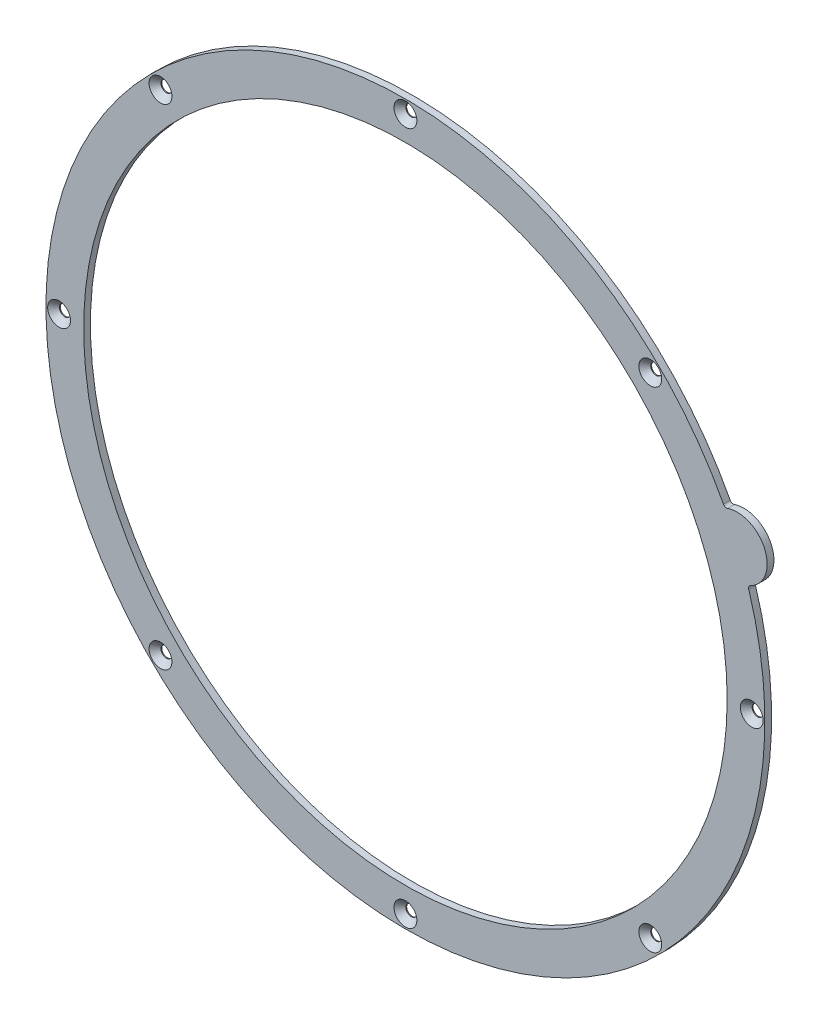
ISO-10303-21;
HEADER;
FILE_DESCRIPTION(('STEP AP214'),'2;1');
FILE_NAME('part.step','',(''),(''),'','','');
FILE_SCHEMA(('AUTOMOTIVE_DESIGN { 1 0 10303 214 1 1 1 1 }'));
ENDSEC;
DATA;
#1=APPLICATION_CONTEXT('core data for automotive mechanical design processes');
#2=APPLICATION_PROTOCOL_DEFINITION('international standard','automotive_design',2000,#1);
#3=PRODUCT_CONTEXT('',#1,'mechanical');
#4=PRODUCT('Part','Part','',(#3));
#5=PRODUCT_RELATED_PRODUCT_CATEGORY('part','',(#4));
#6=PRODUCT_DEFINITION_FORMATION('','',#4);
#7=PRODUCT_DEFINITION_CONTEXT('part definition',#1,'design');
#8=PRODUCT_DEFINITION('design','',#6,#7);
#9=PRODUCT_DEFINITION_SHAPE('','',#8);
#10=(LENGTH_UNIT() NAMED_UNIT(*) SI_UNIT(.MILLI.,.METRE.));
#11=(NAMED_UNIT(*) PLANE_ANGLE_UNIT() SI_UNIT($,.RADIAN.));
#12=(NAMED_UNIT(*) SI_UNIT($,.STERADIAN.) SOLID_ANGLE_UNIT());
#13=UNCERTAINTY_MEASURE_WITH_UNIT(LENGTH_MEASURE(1.E-05),#10,'distance_accuracy_value','');
#14=(GEOMETRIC_REPRESENTATION_CONTEXT(3) GLOBAL_UNCERTAINTY_ASSIGNED_CONTEXT((#13)) GLOBAL_UNIT_ASSIGNED_CONTEXT((#10,
#11,#12)) REPRESENTATION_CONTEXT('',''));
#15=CARTESIAN_POINT('',(0.,0.,0.));
#16=DIRECTION('',(0.,0.,1.));
#17=DIRECTION('',(1.,0.,0.));
#18=AXIS2_PLACEMENT_3D('',#15,#16,#17);
#19=CARTESIAN_POINT('',(0.,0.,4.));
#20=DIRECTION('',(0.,0.,1.));
#21=DIRECTION('',(1.,0.,0.));
#22=AXIS2_PLACEMENT_3D('',#19,#20,#21);
#23=PLANE('',#22);
#24=CARTESIAN_POINT('',(195.862460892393,81.1288876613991,4.));
#25=DIRECTION('',(0.,0.,1.));
#26=DIRECTION('',(1.,0.,0.));
#27=AXIS2_PLACEMENT_3D('',#24,#25,#26);
#28=CIRCLE('',#27,17.75);
#29=CARTESIAN_POINT('',(203.753669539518,65.2294749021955,4.));
#30=VERTEX_POINT('',#29);
#31=CARTESIAN_POINT('',(190.199805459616,97.9513973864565,4.));
#32=VERTEX_POINT('',#31);
#33=EDGE_CURVE('E161',#30,#32,#28,.T.);
#34=ORIENTED_EDGE('',*,*,#33,.T.);
#35=CARTESIAN_POINT('',(189.56175977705,99.8468914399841,4.));
#36=DIRECTION('',(0.,0.,1.));
#37=DIRECTION('',(1.,0.,0.));
#38=AXIS2_PLACEMENT_3D('',#35,#36,#37);
#39=CIRCLE('',#38,2.);
#40=CARTESIAN_POINT('',(187.792221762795,98.9148317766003,4.));
#41=VERTEX_POINT('',#40);
#42=EDGE_CURVE('E85',#32,#41,#39,.F.);
#43=ORIENTED_EDGE('',*,*,#42,.T.);
#44=CARTESIAN_POINT('',(0.,0.,4.));
#45=DIRECTION('',(0.,0.,1.));
#46=DIRECTION('',(1.,0.,0.));
#47=AXIS2_PLACEMENT_3D('',#44,#45,#46);
#48=CIRCLE('',#47,212.25);
#49=CARTESIAN_POINT('',(202.732501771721,62.8458051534,4.));
#50=VERTEX_POINT('',#49);
#51=EDGE_CURVE('E94',#41,#50,#48,.T.);
#52=ORIENTED_EDGE('',*,*,#51,.T.);
#53=CARTESIAN_POINT('',(204.642819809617,63.4379917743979,4.));
#54=DIRECTION('',(0.,0.,1.));
#55=DIRECTION('',(1.,0.,0.));
#56=AXIS2_PLACEMENT_3D('',#53,#54,#55);
#57=CIRCLE('',#56,2.);
#58=EDGE_CURVE('E46',#50,#30,#57,.F.);
#59=ORIENTED_EDGE('',*,*,#58,.T.);
#60=EDGE_LOOP('',(#34,#43,#52,#59));
#61=FACE_BOUND('',#60,.T.);
#62=CARTESIAN_POINT('',(-144.603336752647,144.603336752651,4.));
#63=DIRECTION('',(0.,0.,1.));
#64=DIRECTION('',(1.,0.,0.));
#65=AXIS2_PLACEMENT_3D('',#62,#63,#64);
#66=CIRCLE('',#65,6.75000000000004);
#67=CARTESIAN_POINT('',(-137.853336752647,144.603336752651,4.));
#68=VERTEX_POINT('',#67);
#69=EDGE_CURVE('E154',#68,#68,#66,.F.);
#70=ORIENTED_EDGE('',*,*,#69,.T.);
#71=EDGE_LOOP('',(#70));
#72=FACE_BOUND('',#71,.T.);
#73=CARTESIAN_POINT('',(-204.5,2.14202380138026E-12,4.));
#74=DIRECTION('',(0.,0.,1.));
#75=DIRECTION('',(1.,0.,0.));
#76=AXIS2_PLACEMENT_3D('',#73,#74,#75);
#77=CIRCLE('',#76,6.75000000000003);
#78=CARTESIAN_POINT('',(-197.75,2.14202380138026E-12,4.));
#79=VERTEX_POINT('',#78);
#80=EDGE_CURVE('E148',#79,#79,#77,.F.);
#81=ORIENTED_EDGE('',*,*,#80,.T.);
#82=EDGE_LOOP('',(#81));
#83=FACE_BOUND('',#82,.T.);
#84=CARTESIAN_POINT('',(-144.60333675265,-144.603336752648,4.));
#85=DIRECTION('',(0.,0.,1.));
#86=DIRECTION('',(1.,0.,0.));
#87=AXIS2_PLACEMENT_3D('',#84,#85,#86);
#88=CIRCLE('',#87,6.74999999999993);
#89=CARTESIAN_POINT('',(-137.85333675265,-144.603336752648,4.));
#90=VERTEX_POINT('',#89);
#91=EDGE_CURVE('E142',#90,#90,#88,.F.);
#92=ORIENTED_EDGE('',*,*,#91,.T.);
#93=EDGE_LOOP('',(#92));
#94=FACE_BOUND('',#93,.T.);
#95=CARTESIAN_POINT('',(-1.42801586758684E-12,-204.5,4.));
#96=DIRECTION('',(0.,0.,1.));
#97=DIRECTION('',(1.,0.,0.));
#98=AXIS2_PLACEMENT_3D('',#95,#96,#97);
#99=CIRCLE('',#98,6.75000000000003);
#100=CARTESIAN_POINT('',(6.74999999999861,-204.5,4.));
#101=VERTEX_POINT('',#100);
#102=EDGE_CURVE('E136',#101,#101,#99,.F.);
#103=ORIENTED_EDGE('',*,*,#102,.T.);
#104=EDGE_LOOP('',(#103));
#105=FACE_BOUND('',#104,.T.);
#106=CARTESIAN_POINT('',(144.603336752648,-144.60333675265,4.));
#107=DIRECTION('',(0.,0.,1.));
#108=DIRECTION('',(1.,0.,0.));
#109=AXIS2_PLACEMENT_3D('',#106,#107,#108);
#110=CIRCLE('',#109,6.74999999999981);
#111=CARTESIAN_POINT('',(151.353336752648,-144.60333675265,4.));
#112=VERTEX_POINT('',#111);
#113=EDGE_CURVE('E130',#112,#112,#110,.F.);
#114=ORIENTED_EDGE('',*,*,#113,.T.);
#115=EDGE_LOOP('',(#114));
#116=FACE_BOUND('',#115,.T.);
#117=CARTESIAN_POINT('',(204.5,-7.14007933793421E-13,4.));
#118=DIRECTION('',(0.,0.,1.));
#119=DIRECTION('',(1.,0.,0.));
#120=AXIS2_PLACEMENT_3D('',#117,#118,#119);
#121=CIRCLE('',#120,6.75000000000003);
#122=CARTESIAN_POINT('',(211.25,-7.14007933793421E-13,4.));
#123=VERTEX_POINT('',#122);
#124=EDGE_CURVE('E124',#123,#123,#121,.F.);
#125=ORIENTED_EDGE('',*,*,#124,.T.);
#126=EDGE_LOOP('',(#125));
#127=FACE_BOUND('',#126,.T.);
#128=CARTESIAN_POINT('',(144.603336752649,144.603336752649,4.));
#129=DIRECTION('',(0.,0.,1.));
#130=DIRECTION('',(1.,0.,0.));
#131=AXIS2_PLACEMENT_3D('',#128,#129,#130);
#132=CIRCLE('',#131,6.74999999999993);
#133=CARTESIAN_POINT('',(151.353336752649,144.603336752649,4.));
#134=VERTEX_POINT('',#133);
#135=EDGE_CURVE('E118',#134,#134,#132,.F.);
#136=ORIENTED_EDGE('',*,*,#135,.T.);
#137=EDGE_LOOP('',(#136));
#138=FACE_BOUND('',#137,.T.);
#139=CARTESIAN_POINT('',(0.,204.5,4.));
#140=DIRECTION('',(0.,0.,1.));
#141=DIRECTION('',(1.,0.,0.));
#142=AXIS2_PLACEMENT_3D('',#139,#140,#141);
#143=CIRCLE('',#142,6.75000000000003);
#144=CARTESIAN_POINT('',(6.75000000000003,204.5,4.));
#145=VERTEX_POINT('',#144);
#146=EDGE_CURVE('E112',#145,#145,#143,.F.);
#147=ORIENTED_EDGE('',*,*,#146,.T.);
#148=EDGE_LOOP('',(#147));
#149=FACE_BOUND('',#148,.T.);
#150=CARTESIAN_POINT('',(0.,0.,4.));
#151=DIRECTION('',(0.,0.,1.));
#152=DIRECTION('',(1.,0.,0.));
#153=AXIS2_PLACEMENT_3D('',#150,#151,#152);
#154=CIRCLE('',#153,190.);
#155=CARTESIAN_POINT('',(190.,0.,4.));
#156=VERTEX_POINT('',#155);
#157=EDGE_CURVE('E101',#156,#156,#154,.T.);
#158=ORIENTED_EDGE('',*,*,#157,.F.);
#159=EDGE_LOOP('',(#158));
#160=FACE_BOUND('',#159,.T.);
#161=ADVANCED_FACE('F38',(#61,#72,#83,#94,#105,#116,#127,#138,#149,#160),#23,.T.);
#162=CARTESIAN_POINT('',(0.,0.,0.));
#163=DIRECTION('',(0.,0.,1.));
#164=DIRECTION('',(1.,0.,0.));
#165=AXIS2_PLACEMENT_3D('',#162,#163,#164);
#166=PLANE('',#165);
#167=CARTESIAN_POINT('',(-144.603336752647,144.603336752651,0.));
#168=DIRECTION('',(0.,0.,1.));
#169=DIRECTION('',(0.707106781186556,0.707106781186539,0.));
#170=AXIS2_PLACEMENT_3D('',#167,#168,#169);
#171=CIRCLE('',#170,3.25);
#172=CARTESIAN_POINT('',(-142.305239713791,146.901433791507,0.));
#173=VERTEX_POINT('',#172);
#174=EDGE_CURVE('E165',#173,#173,#171,.T.);
#175=ORIENTED_EDGE('',*,*,#174,.T.);
#176=EDGE_LOOP('',(#175));
#177=FACE_BOUND('',#176,.T.);
#178=CARTESIAN_POINT('',(-204.5,2.14202380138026E-12,0.));
#179=DIRECTION('',(0.,0.,1.));
#180=DIRECTION('',(0.,1.,0.));
#181=AXIS2_PLACEMENT_3D('',#178,#179,#180);
#182=CIRCLE('',#181,3.25);
#183=CARTESIAN_POINT('',(-204.5,3.25000000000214,0.));
#184=VERTEX_POINT('',#183);
#185=EDGE_CURVE('E170',#184,#184,#182,.T.);
#186=ORIENTED_EDGE('',*,*,#185,.T.);
#187=EDGE_LOOP('',(#186));
#188=FACE_BOUND('',#187,.T.);
#189=CARTESIAN_POINT('',(-144.60333675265,-144.603336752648,0.));
#190=DIRECTION('',(0.,0.,1.));
#191=DIRECTION('',(-0.707106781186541,0.707106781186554,0.));
#192=AXIS2_PLACEMENT_3D('',#189,#190,#191);
#193=CIRCLE('',#192,3.25);
#194=CARTESIAN_POINT('',(-146.901433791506,-142.305239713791,0.));
#195=VERTEX_POINT('',#194);
#196=EDGE_CURVE('E173',#195,#195,#193,.T.);
#197=ORIENTED_EDGE('',*,*,#196,.T.);
#198=EDGE_LOOP('',(#197));
#199=FACE_BOUND('',#198,.T.);
#200=CARTESIAN_POINT('',(-1.42801586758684E-12,-204.5,0.));
#201=DIRECTION('',(0.,0.,1.));
#202=DIRECTION('',(-1.,0.,0.));
#203=AXIS2_PLACEMENT_3D('',#200,#201,#202);
#204=CIRCLE('',#203,3.25);
#205=CARTESIAN_POINT('',(-3.25000000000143,-204.5,0.));
#206=VERTEX_POINT('',#205);
#207=EDGE_CURVE('E176',#206,#206,#204,.T.);
#208=ORIENTED_EDGE('',*,*,#207,.T.);
#209=EDGE_LOOP('',(#208));
#210=FACE_BOUND('',#209,.T.);
#211=CARTESIAN_POINT('',(144.603336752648,-144.60333675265,0.));
#212=DIRECTION('',(0.,0.,1.));
#213=DIRECTION('',(-0.707106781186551,-0.707106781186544,0.));
#214=AXIS2_PLACEMENT_3D('',#211,#212,#213);
#215=CIRCLE('',#214,3.25);
#216=CARTESIAN_POINT('',(142.305239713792,-146.901433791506,0.));
#217=VERTEX_POINT('',#216);
#218=EDGE_CURVE('E179',#217,#217,#215,.T.);
#219=ORIENTED_EDGE('',*,*,#218,.T.);
#220=EDGE_LOOP('',(#219));
#221=FACE_BOUND('',#220,.T.);
#222=CARTESIAN_POINT('',(204.5,-7.14007933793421E-13,0.));
#223=DIRECTION('',(0.,0.,1.));
#224=DIRECTION('',(0.,-1.,0.));
#225=AXIS2_PLACEMENT_3D('',#222,#223,#224);
#226=CIRCLE('',#225,3.25);
#227=CARTESIAN_POINT('',(204.5,-3.25000000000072,0.));
#228=VERTEX_POINT('',#227);
#229=EDGE_CURVE('E182',#228,#228,#226,.T.);
#230=ORIENTED_EDGE('',*,*,#229,.T.);
#231=EDGE_LOOP('',(#230));
#232=FACE_BOUND('',#231,.T.);
#233=CARTESIAN_POINT('',(144.603336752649,144.603336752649,0.));
#234=DIRECTION('',(0.,0.,1.));
#235=DIRECTION('',(0.707106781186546,-0.707106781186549,0.));
#236=AXIS2_PLACEMENT_3D('',#233,#234,#235);
#237=CIRCLE('',#236,3.25);
#238=CARTESIAN_POINT('',(146.901433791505,142.305239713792,0.));
#239=VERTEX_POINT('',#238);
#240=EDGE_CURVE('E185',#239,#239,#237,.T.);
#241=ORIENTED_EDGE('',*,*,#240,.T.);
#242=EDGE_LOOP('',(#241));
#243=FACE_BOUND('',#242,.T.);
#244=CARTESIAN_POINT('',(0.,204.5,0.));
#245=DIRECTION('',(0.,0.,1.));
#246=DIRECTION('',(1.,0.,0.));
#247=AXIS2_PLACEMENT_3D('',#244,#245,#246);
#248=CIRCLE('',#247,3.25);
#249=CARTESIAN_POINT('',(3.25,204.5,0.));
#250=VERTEX_POINT('',#249);
#251=EDGE_CURVE('E188',#250,#250,#248,.T.);
#252=ORIENTED_EDGE('',*,*,#251,.T.);
#253=EDGE_LOOP('',(#252));
#254=FACE_BOUND('',#253,.T.);
#255=CARTESIAN_POINT('',(0.,0.,0.));
#256=DIRECTION('',(0.,0.,1.));
#257=DIRECTION('',(1.,0.,0.));
#258=AXIS2_PLACEMENT_3D('',#255,#256,#257);
#259=CIRCLE('',#258,212.25);
#260=CARTESIAN_POINT('',(187.792221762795,98.9148317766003,0.));
#261=VERTEX_POINT('',#260);
#262=CARTESIAN_POINT('',(202.732501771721,62.8458051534,0.));
#263=VERTEX_POINT('',#262);
#264=EDGE_CURVE('E92',#261,#263,#259,.T.);
#265=ORIENTED_EDGE('',*,*,#264,.F.);
#266=CARTESIAN_POINT('',(189.56175977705,99.8468914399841,0.));
#267=DIRECTION('',(0.,0.,1.));
#268=DIRECTION('',(1.,0.,0.));
#269=AXIS2_PLACEMENT_3D('',#266,#267,#268);
#270=CIRCLE('',#269,2.);
#271=CARTESIAN_POINT('',(190.199805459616,97.9513973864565,0.));
#272=VERTEX_POINT('',#271);
#273=EDGE_CURVE('E77',#261,#272,#270,.T.);
#274=ORIENTED_EDGE('',*,*,#273,.T.);
#275=CARTESIAN_POINT('',(195.862460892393,81.1288876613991,0.));
#276=DIRECTION('',(0.,0.,1.));
#277=DIRECTION('',(1.,0.,0.));
#278=AXIS2_PLACEMENT_3D('',#275,#276,#277);
#279=CIRCLE('',#278,17.75);
#280=CARTESIAN_POINT('',(203.753669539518,65.2294749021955,0.));
#281=VERTEX_POINT('',#280);
#282=EDGE_CURVE('E163',#272,#281,#279,.F.);
#283=ORIENTED_EDGE('',*,*,#282,.T.);
#284=CARTESIAN_POINT('',(204.642819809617,63.4379917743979,0.));
#285=DIRECTION('',(0.,0.,1.));
#286=DIRECTION('',(1.,0.,0.));
#287=AXIS2_PLACEMENT_3D('',#284,#285,#286);
#288=CIRCLE('',#287,2.);
#289=EDGE_CURVE('E11',#281,#263,#288,.T.);
#290=ORIENTED_EDGE('',*,*,#289,.T.);
#291=EDGE_LOOP('',(#265,#274,#283,#290));
#292=FACE_BOUND('',#291,.T.);
#293=CARTESIAN_POINT('',(0.,0.,0.));
#294=DIRECTION('',(0.,0.,1.));
#295=DIRECTION('',(1.,0.,0.));
#296=AXIS2_PLACEMENT_3D('',#293,#294,#295);
#297=CIRCLE('',#296,190.);
#298=CARTESIAN_POINT('',(190.,0.,0.));
#299=VERTEX_POINT('',#298);
#300=EDGE_CURVE('E106',#299,#299,#297,.T.);
#301=ORIENTED_EDGE('',*,*,#300,.T.);
#302=EDGE_LOOP('',(#301));
#303=FACE_BOUND('',#302,.T.);
#304=ADVANCED_FACE('F98',(#177,#188,#199,#210,#221,#232,#243,#254,#292,#303),#166,.F.);
#305=CARTESIAN_POINT('',(0.,0.,4.));
#306=DIRECTION('',(0.,0.,-1.));
#307=DIRECTION('',(-1.,0.,0.));
#308=AXIS2_PLACEMENT_3D('',#305,#306,#307);
#309=CYLINDRICAL_SURFACE('',#308,212.25);
#310=ORIENTED_EDGE('',*,*,#51,.F.);
#311=DIRECTION('',(0.,0.,-1.));
#312=VECTOR('',#311,1.);
#313=CARTESIAN_POINT('',(187.792221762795,98.9148317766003,4.));
#314=LINE('',#313,#312);
#315=EDGE_CURVE('E81',#41,#261,#314,.T.);
#316=ORIENTED_EDGE('',*,*,#315,.T.);
#317=ORIENTED_EDGE('',*,*,#264,.T.);
#318=DIRECTION('',(0.,0.,-1.));
#319=VECTOR('',#318,1.);
#320=CARTESIAN_POINT('',(202.732501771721,62.8458051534,4.));
#321=LINE('',#320,#319);
#322=EDGE_CURVE('E96',#263,#50,#321,.F.);
#323=ORIENTED_EDGE('',*,*,#322,.T.);
#324=EDGE_LOOP('',(#310,#316,#317,#323));
#325=FACE_BOUND('',#324,.T.);
#326=ADVANCED_FACE('F90',(#325),#309,.T.);
#327=CARTESIAN_POINT('',(0.,0.,4.));
#328=DIRECTION('',(0.,0.,-1.));
#329=DIRECTION('',(-1.,0.,0.));
#330=AXIS2_PLACEMENT_3D('',#327,#328,#329);
#331=CYLINDRICAL_SURFACE('',#330,190.);
#332=ORIENTED_EDGE('',*,*,#157,.T.);
#333=EDGE_LOOP('',(#332));
#334=FACE_BOUND('',#333,.T.);
#335=ORIENTED_EDGE('',*,*,#300,.F.);
#336=EDGE_LOOP('',(#335));
#337=FACE_BOUND('',#336,.T.);
#338=ADVANCED_FACE('F193',(#334,#337),#331,.F.);
#339=CARTESIAN_POINT('',(0.,204.5,0.));
#340=DIRECTION('',(0.,0.,1.));
#341=DIRECTION('',(1.,0.,0.));
#342=AXIS2_PLACEMENT_3D('',#339,#340,#341);
#343=CYLINDRICAL_SURFACE('',#342,3.25);
#344=CARTESIAN_POINT('',(0.,204.5,0.499999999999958));
#345=DIRECTION('',(0.,0.,1.));
#346=DIRECTION('',(1.,0.,0.));
#347=AXIS2_PLACEMENT_3D('',#344,#345,#346);
#348=CIRCLE('',#347,3.25);
#349=CARTESIAN_POINT('',(3.25,204.5,0.499999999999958));
#350=VERTEX_POINT('',#349);
#351=EDGE_CURVE('E103',#350,#350,#348,.T.);
#352=ORIENTED_EDGE('',*,*,#351,.T.);
#353=EDGE_LOOP('',(#352));
#354=FACE_BOUND('',#353,.T.);
#355=ORIENTED_EDGE('',*,*,#251,.F.);
#356=EDGE_LOOP('',(#355));
#357=FACE_BOUND('',#356,.T.);
#358=ADVANCED_FACE('F195',(#354,#357),#343,.F.);
#359=CARTESIAN_POINT('',(0.,204.5,0.499999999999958));
#360=DIRECTION('',(0.,0.,1.));
#361=DIRECTION('',(1.,0.,0.));
#362=AXIS2_PLACEMENT_3D('',#359,#360,#361);
#363=CONICAL_SURFACE('',#362,3.25,0.785398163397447);
#364=ORIENTED_EDGE('',*,*,#146,.F.);
#365=EDGE_LOOP('',(#364));
#366=FACE_BOUND('',#365,.T.);
#367=ORIENTED_EDGE('',*,*,#351,.F.);
#368=EDGE_LOOP('',(#367));
#369=FACE_BOUND('',#368,.T.);
#370=ADVANCED_FACE('F202',(#366,#369),#363,.F.);
#371=CARTESIAN_POINT('',(144.603336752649,144.603336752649,0.));
#372=DIRECTION('',(0.,0.,1.));
#373=DIRECTION('',(1.,0.,0.));
#374=AXIS2_PLACEMENT_3D('',#371,#372,#373);
#375=CYLINDRICAL_SURFACE('',#374,3.25);
#376=CARTESIAN_POINT('',(144.603336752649,144.603336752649,0.500000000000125));
#377=DIRECTION('',(0.,0.,1.));
#378=DIRECTION('',(1.,0.,0.));
#379=AXIS2_PLACEMENT_3D('',#376,#377,#378);
#380=CIRCLE('',#379,3.25);
#381=CARTESIAN_POINT('',(147.853336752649,144.603336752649,0.500000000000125));
#382=VERTEX_POINT('',#381);
#383=EDGE_CURVE('E115',#382,#382,#380,.T.);
#384=ORIENTED_EDGE('',*,*,#383,.T.);
#385=EDGE_LOOP('',(#384));
#386=FACE_BOUND('',#385,.T.);
#387=ORIENTED_EDGE('',*,*,#240,.F.);
#388=EDGE_LOOP('',(#387));
#389=FACE_BOUND('',#388,.T.);
#390=ADVANCED_FACE('F216',(#386,#389),#375,.F.);
#391=CARTESIAN_POINT('',(204.5,-7.14007933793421E-13,0.));
#392=DIRECTION('',(0.,0.,1.));
#393=DIRECTION('',(1.,0.,0.));
#394=AXIS2_PLACEMENT_3D('',#391,#392,#393);
#395=CYLINDRICAL_SURFACE('',#394,3.25);
#396=CARTESIAN_POINT('',(204.5,-7.14007933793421E-13,0.499999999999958));
#397=DIRECTION('',(0.,0.,1.));
#398=DIRECTION('',(1.,0.,0.));
#399=AXIS2_PLACEMENT_3D('',#396,#397,#398);
#400=CIRCLE('',#399,3.25);
#401=CARTESIAN_POINT('',(207.75,-7.14007933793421E-13,0.499999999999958));
#402=VERTEX_POINT('',#401);
#403=EDGE_CURVE('E121',#402,#402,#400,.T.);
#404=ORIENTED_EDGE('',*,*,#403,.T.);
#405=EDGE_LOOP('',(#404));
#406=FACE_BOUND('',#405,.T.);
#407=ORIENTED_EDGE('',*,*,#229,.F.);
#408=EDGE_LOOP('',(#407));
#409=FACE_BOUND('',#408,.T.);
#410=ADVANCED_FACE('F275',(#406,#409),#395,.F.);
#411=CARTESIAN_POINT('',(144.603336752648,-144.60333675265,0.));
#412=DIRECTION('',(0.,0.,1.));
#413=DIRECTION('',(1.,0.,0.));
#414=AXIS2_PLACEMENT_3D('',#411,#412,#413);
#415=CYLINDRICAL_SURFACE('',#414,3.25);
#416=CARTESIAN_POINT('',(144.603336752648,-144.60333675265,0.500000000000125));
#417=DIRECTION('',(0.,0.,1.));
#418=DIRECTION('',(1.,0.,0.));
#419=AXIS2_PLACEMENT_3D('',#416,#417,#418);
#420=CIRCLE('',#419,3.25);
#421=CARTESIAN_POINT('',(147.853336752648,-144.60333675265,0.500000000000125));
#422=VERTEX_POINT('',#421);
#423=EDGE_CURVE('E127',#422,#422,#420,.T.);
#424=ORIENTED_EDGE('',*,*,#423,.T.);
#425=EDGE_LOOP('',(#424));
#426=FACE_BOUND('',#425,.T.);
#427=ORIENTED_EDGE('',*,*,#218,.F.);
#428=EDGE_LOOP('',(#427));
#429=FACE_BOUND('',#428,.T.);
#430=ADVANCED_FACE('F271',(#426,#429),#415,.F.);
#431=CARTESIAN_POINT('',(-1.42801586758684E-12,-204.5,0.));
#432=DIRECTION('',(0.,0.,1.));
#433=DIRECTION('',(1.,0.,0.));
#434=AXIS2_PLACEMENT_3D('',#431,#432,#433);
#435=CYLINDRICAL_SURFACE('',#434,3.25);
#436=CARTESIAN_POINT('',(-1.42801586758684E-12,-204.5,0.499999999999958));
#437=DIRECTION('',(0.,0.,1.));
#438=DIRECTION('',(1.,0.,0.));
#439=AXIS2_PLACEMENT_3D('',#436,#437,#438);
#440=CIRCLE('',#439,3.25);
#441=CARTESIAN_POINT('',(3.24999999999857,-204.5,0.499999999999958));
#442=VERTEX_POINT('',#441);
#443=EDGE_CURVE('E133',#442,#442,#440,.T.);
#444=ORIENTED_EDGE('',*,*,#443,.T.);
#445=EDGE_LOOP('',(#444));
#446=FACE_BOUND('',#445,.T.);
#447=ORIENTED_EDGE('',*,*,#207,.F.);
#448=EDGE_LOOP('',(#447));
#449=FACE_BOUND('',#448,.T.);
#450=ADVANCED_FACE('F267',(#446,#449),#435,.F.);
#451=CARTESIAN_POINT('',(-144.60333675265,-144.603336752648,0.));
#452=DIRECTION('',(0.,0.,1.));
#453=DIRECTION('',(1.,0.,0.));
#454=AXIS2_PLACEMENT_3D('',#451,#452,#453);
#455=CYLINDRICAL_SURFACE('',#454,3.25);
#456=CARTESIAN_POINT('',(-144.60333675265,-144.603336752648,0.500000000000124));
#457=DIRECTION('',(0.,0.,1.));
#458=DIRECTION('',(1.,0.,0.));
#459=AXIS2_PLACEMENT_3D('',#456,#457,#458);
#460=CIRCLE('',#459,3.25);
#461=CARTESIAN_POINT('',(-141.35333675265,-144.603336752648,0.500000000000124));
#462=VERTEX_POINT('',#461);
#463=EDGE_CURVE('E139',#462,#462,#460,.T.);
#464=ORIENTED_EDGE('',*,*,#463,.T.);
#465=EDGE_LOOP('',(#464));
#466=FACE_BOUND('',#465,.T.);
#467=ORIENTED_EDGE('',*,*,#196,.F.);
#468=EDGE_LOOP('',(#467));
#469=FACE_BOUND('',#468,.T.);
#470=ADVANCED_FACE('F263',(#466,#469),#455,.F.);
#471=CARTESIAN_POINT('',(-204.5,2.14202380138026E-12,0.));
#472=DIRECTION('',(0.,0.,1.));
#473=DIRECTION('',(1.,0.,0.));
#474=AXIS2_PLACEMENT_3D('',#471,#472,#473);
#475=CYLINDRICAL_SURFACE('',#474,3.25);
#476=CARTESIAN_POINT('',(-204.5,2.14202380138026E-12,0.499999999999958));
#477=DIRECTION('',(0.,0.,1.));
#478=DIRECTION('',(1.,0.,0.));
#479=AXIS2_PLACEMENT_3D('',#476,#477,#478);
#480=CIRCLE('',#479,3.25);
#481=CARTESIAN_POINT('',(-201.25,2.14202380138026E-12,0.499999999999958));
#482=VERTEX_POINT('',#481);
#483=EDGE_CURVE('E145',#482,#482,#480,.T.);
#484=ORIENTED_EDGE('',*,*,#483,.T.);
#485=EDGE_LOOP('',(#484));
#486=FACE_BOUND('',#485,.T.);
#487=ORIENTED_EDGE('',*,*,#185,.F.);
#488=EDGE_LOOP('',(#487));
#489=FACE_BOUND('',#488,.T.);
#490=ADVANCED_FACE('F259',(#486,#489),#475,.F.);
#491=CARTESIAN_POINT('',(-144.603336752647,144.603336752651,0.));
#492=DIRECTION('',(0.,0.,1.));
#493=DIRECTION('',(1.,0.,0.));
#494=AXIS2_PLACEMENT_3D('',#491,#492,#493);
#495=CYLINDRICAL_SURFACE('',#494,3.25);
#496=CARTESIAN_POINT('',(-144.603336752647,144.603336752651,0.500000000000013));
#497=DIRECTION('',(0.,0.,1.));
#498=DIRECTION('',(1.,0.,0.));
#499=AXIS2_PLACEMENT_3D('',#496,#497,#498);
#500=CIRCLE('',#499,3.25);
#501=CARTESIAN_POINT('',(-141.353336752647,144.603336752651,0.500000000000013));
#502=VERTEX_POINT('',#501);
#503=EDGE_CURVE('E151',#502,#502,#500,.T.);
#504=ORIENTED_EDGE('',*,*,#503,.T.);
#505=EDGE_LOOP('',(#504));
#506=FACE_BOUND('',#505,.T.);
#507=ORIENTED_EDGE('',*,*,#174,.F.);
#508=EDGE_LOOP('',(#507));
#509=FACE_BOUND('',#508,.T.);
#510=ADVANCED_FACE('F222',(#506,#509),#495,.F.);
#511=CARTESIAN_POINT('',(144.603336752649,144.603336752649,0.500000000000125));
#512=DIRECTION('',(0.,0.,1.));
#513=DIRECTION('',(1.,0.,0.));
#514=AXIS2_PLACEMENT_3D('',#511,#512,#513);
#515=CONICAL_SURFACE('',#514,3.25,0.785398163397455);
#516=ORIENTED_EDGE('',*,*,#135,.F.);
#517=EDGE_LOOP('',(#516));
#518=FACE_BOUND('',#517,.T.);
#519=ORIENTED_EDGE('',*,*,#383,.F.);
#520=EDGE_LOOP('',(#519));
#521=FACE_BOUND('',#520,.T.);
#522=ADVANCED_FACE('F218',(#518,#521),#515,.F.);
#523=CARTESIAN_POINT('',(204.5,-7.14007933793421E-13,0.499999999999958));
#524=DIRECTION('',(0.,0.,1.));
#525=DIRECTION('',(1.,0.,0.));
#526=AXIS2_PLACEMENT_3D('',#523,#524,#525);
#527=CONICAL_SURFACE('',#526,3.25,0.785398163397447);
#528=ORIENTED_EDGE('',*,*,#124,.F.);
#529=EDGE_LOOP('',(#528));
#530=FACE_BOUND('',#529,.T.);
#531=ORIENTED_EDGE('',*,*,#403,.F.);
#532=EDGE_LOOP('',(#531));
#533=FACE_BOUND('',#532,.T.);
#534=ADVANCED_FACE('F221',(#530,#533),#527,.F.);
#535=CARTESIAN_POINT('',(144.603336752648,-144.60333675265,0.500000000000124));
#536=DIRECTION('',(0.,0.,1.));
#537=DIRECTION('',(1.,0.,0.));
#538=AXIS2_PLACEMENT_3D('',#535,#536,#537);
#539=CONICAL_SURFACE('',#538,3.25,0.785398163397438);
#540=CARTESIAN_POINT('',(151.353336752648,-144.60333675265,4.));
#541=CARTESIAN_POINT('',(151.316878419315,-144.60333675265,3.96354166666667));
#542=CARTESIAN_POINT('',(151.280420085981,-144.60333675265,3.92708333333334));
#543=CARTESIAN_POINT('',(151.207503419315,-144.60333675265,3.85416666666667));
#544=CARTESIAN_POINT('',(151.171045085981,-144.60333675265,3.81770833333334));
#545=CARTESIAN_POINT('',(151.098128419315,-144.60333675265,3.74479166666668));
#546=CARTESIAN_POINT('',(151.061670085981,-144.60333675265,3.70833333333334));
#547=CARTESIAN_POINT('',(150.988753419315,-144.60333675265,3.63541666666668));
#548=CARTESIAN_POINT('',(150.952295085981,-144.60333675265,3.59895833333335));
#549=CARTESIAN_POINT('',(150.879378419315,-144.60333675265,3.52604166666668));
#550=CARTESIAN_POINT('',(150.842920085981,-144.60333675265,3.48958333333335));
#551=CARTESIAN_POINT('',(150.770003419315,-144.60333675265,3.41666666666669));
#552=CARTESIAN_POINT('',(150.733545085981,-144.60333675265,3.38020833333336));
#553=CARTESIAN_POINT('',(150.660628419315,-144.60333675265,3.30729166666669));
#554=CARTESIAN_POINT('',(150.624170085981,-144.60333675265,3.27083333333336));
#555=CARTESIAN_POINT('',(150.551253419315,-144.60333675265,3.1979166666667));
#556=CARTESIAN_POINT('',(150.514795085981,-144.60333675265,3.16145833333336));
#557=CARTESIAN_POINT('',(150.441878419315,-144.60333675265,3.0885416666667));
#558=CARTESIAN_POINT('',(150.405420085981,-144.60333675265,3.05208333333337));
#559=CARTESIAN_POINT('',(150.332503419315,-144.60333675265,2.9791666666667));
#560=CARTESIAN_POINT('',(150.296045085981,-144.60333675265,2.94270833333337));
#561=CARTESIAN_POINT('',(150.223128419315,-144.60333675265,2.86979166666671));
#562=CARTESIAN_POINT('',(150.186670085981,-144.60333675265,2.83333333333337));
#563=CARTESIAN_POINT('',(150.113753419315,-144.60333675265,2.76041666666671));
#564=CARTESIAN_POINT('',(150.077295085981,-144.60333675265,2.72395833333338));
#565=CARTESIAN_POINT('',(150.004378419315,-144.60333675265,2.65104166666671));
#566=CARTESIAN_POINT('',(149.967920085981,-144.60333675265,2.61458333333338));
#567=CARTESIAN_POINT('',(149.895003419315,-144.60333675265,2.54166666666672));
#568=CARTESIAN_POINT('',(149.858545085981,-144.60333675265,2.50520833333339));
#569=CARTESIAN_POINT('',(149.785628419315,-144.60333675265,2.43229166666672));
#570=CARTESIAN_POINT('',(149.749170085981,-144.60333675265,2.39583333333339));
#571=CARTESIAN_POINT('',(149.676253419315,-144.60333675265,2.32291666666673));
#572=CARTESIAN_POINT('',(149.639795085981,-144.60333675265,2.2864583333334));
#573=CARTESIAN_POINT('',(149.566878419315,-144.60333675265,2.21354166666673));
#574=CARTESIAN_POINT('',(149.530420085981,-144.60333675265,2.1770833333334));
#575=CARTESIAN_POINT('',(149.457503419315,-144.60333675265,2.10416666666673));
#576=CARTESIAN_POINT('',(149.421045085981,-144.60333675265,2.0677083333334));
#577=CARTESIAN_POINT('',(149.348128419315,-144.60333675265,1.99479166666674));
#578=CARTESIAN_POINT('',(149.311670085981,-144.60333675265,1.95833333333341));
#579=CARTESIAN_POINT('',(149.238753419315,-144.60333675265,1.88541666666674));
#580=CARTESIAN_POINT('',(149.202295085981,-144.60333675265,1.84895833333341));
#581=CARTESIAN_POINT('',(149.129378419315,-144.60333675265,1.77604166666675));
#582=CARTESIAN_POINT('',(149.092920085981,-144.60333675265,1.73958333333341));
#583=CARTESIAN_POINT('',(149.020003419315,-144.60333675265,1.66666666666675));
#584=CARTESIAN_POINT('',(148.983545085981,-144.60333675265,1.63020833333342));
#585=CARTESIAN_POINT('',(148.910628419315,-144.60333675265,1.55729166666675));
#586=CARTESIAN_POINT('',(148.874170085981,-144.60333675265,1.52083333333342));
#587=CARTESIAN_POINT('',(148.801253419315,-144.60333675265,1.44791666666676));
#588=CARTESIAN_POINT('',(148.764795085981,-144.60333675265,1.41145833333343));
#589=CARTESIAN_POINT('',(148.691878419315,-144.60333675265,1.33854166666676));
#590=CARTESIAN_POINT('',(148.655420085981,-144.60333675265,1.30208333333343));
#591=CARTESIAN_POINT('',(148.582503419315,-144.60333675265,1.22916666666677));
#592=CARTESIAN_POINT('',(148.546045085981,-144.60333675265,1.19270833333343));
#593=CARTESIAN_POINT('',(148.473128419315,-144.60333675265,1.11979166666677));
#594=CARTESIAN_POINT('',(148.436670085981,-144.60333675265,1.08333333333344));
#595=CARTESIAN_POINT('',(148.363753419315,-144.60333675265,1.01041666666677));
#596=CARTESIAN_POINT('',(148.327295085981,-144.60333675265,0.973958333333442));
#597=CARTESIAN_POINT('',(148.254378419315,-144.60333675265,0.901041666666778));
#598=CARTESIAN_POINT('',(148.217920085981,-144.60333675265,0.864583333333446));
#599=CARTESIAN_POINT('',(148.145003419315,-144.60333675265,0.791666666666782));
#600=CARTESIAN_POINT('',(148.108545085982,-144.60333675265,0.75520833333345));
#601=CARTESIAN_POINT('',(148.035628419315,-144.60333675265,0.682291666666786));
#602=CARTESIAN_POINT('',(147.999170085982,-144.60333675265,0.645833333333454));
#603=CARTESIAN_POINT('',(147.926253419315,-144.60333675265,0.572916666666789));
#604=CARTESIAN_POINT('',(147.889795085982,-144.60333675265,0.536458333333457));
#605=CARTESIAN_POINT('',(147.853336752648,-144.60333675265,0.500000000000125));
#606=B_SPLINE_CURVE_WITH_KNOTS('',3,(#540,#541,#542,#543,#544,#545,#546,#547,#548,#549,#550,
#551,#552,#553,#554,#555,#556,#557,#558,#559,#560,#561,#562,#563,#564,#565,#566,#567,#568,#569,
#570,#571,#572,#573,#574,#575,#576,#577,#578,#579,#580,#581,#582,#583,#584,#585,#586,#587,#588,
#589,#590,#591,#592,#593,#594,#595,#596,#597,#598,#599,#600,#601,#602,#603,#604,#605),
.UNSPECIFIED.,.F.,.F.,(4,2,2,2,2,2,2,2,2,2,2,2,2,2,2,2,2,2,2,2,2,2,2,2,2,2,2,2,2,2,2,2,4),(0.,
0.154679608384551,0.309359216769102,0.464038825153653,0.618718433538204,0.773398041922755,
0.928077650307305,1.08275725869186,1.23743686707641,1.39211647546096,1.54679608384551,
1.70147569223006,1.85615530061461,2.01083490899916,2.16551451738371,2.32019412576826,
2.47487373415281,2.62955334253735,2.7842329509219,2.93891255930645,3.093592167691,
3.24827177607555,3.4029513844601,3.55763099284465,3.7123106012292,3.86699020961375,
4.0216698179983,4.17634942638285,4.3310290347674,4.48570864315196,4.64038825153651,
4.79506785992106,4.94974746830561),.UNSPECIFIED.);
#607=EDGE_CURVE('BSEAM226',#112,#422,#606,.T.);
#608=ORIENTED_EDGE('',*,*,#113,.F.);
#609=ORIENTED_EDGE('',*,*,#423,.F.);
#610=ORIENTED_EDGE('',*,*,#607,.T.);
#611=ORIENTED_EDGE('',*,*,#607,.F.);
#612=EDGE_LOOP('',(#608,#610,#609,#611));
#613=FACE_BOUND('',#612,.T.);
#614=ADVANCED_FACE('F226',(#613),#539,.F.);
#615=CARTESIAN_POINT('',(-1.42801586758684E-12,-204.5,0.499999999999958));
#616=DIRECTION('',(0.,0.,1.));
#617=DIRECTION('',(1.,0.,0.));
#618=AXIS2_PLACEMENT_3D('',#615,#616,#617);
#619=CONICAL_SURFACE('',#618,3.25,0.785398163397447);
#620=ORIENTED_EDGE('',*,*,#102,.F.);
#621=EDGE_LOOP('',(#620));
#622=FACE_BOUND('',#621,.T.);
#623=ORIENTED_EDGE('',*,*,#443,.F.);
#624=EDGE_LOOP('',(#623));
#625=FACE_BOUND('',#624,.T.);
#626=ADVANCED_FACE('F230',(#622,#625),#619,.F.);
#627=CARTESIAN_POINT('',(-144.60333675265,-144.603336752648,0.500000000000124));
#628=DIRECTION('',(0.,0.,1.));
#629=DIRECTION('',(1.,0.,0.));
#630=AXIS2_PLACEMENT_3D('',#627,#628,#629);
#631=CONICAL_SURFACE('',#630,3.25,0.785398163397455);
#632=ORIENTED_EDGE('',*,*,#91,.F.);
#633=EDGE_LOOP('',(#632));
#634=FACE_BOUND('',#633,.T.);
#635=ORIENTED_EDGE('',*,*,#463,.F.);
#636=EDGE_LOOP('',(#635));
#637=FACE_BOUND('',#636,.T.);
#638=ADVANCED_FACE('F234',(#634,#637),#631,.F.);
#639=CARTESIAN_POINT('',(-204.5,2.14202380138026E-12,0.499999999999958));
#640=DIRECTION('',(0.,0.,1.));
#641=DIRECTION('',(1.,0.,0.));
#642=AXIS2_PLACEMENT_3D('',#639,#640,#641);
#643=CONICAL_SURFACE('',#642,3.25,0.785398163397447);
#644=ORIENTED_EDGE('',*,*,#80,.F.);
#645=EDGE_LOOP('',(#644));
#646=FACE_BOUND('',#645,.T.);
#647=ORIENTED_EDGE('',*,*,#483,.F.);
#648=EDGE_LOOP('',(#647));
#649=FACE_BOUND('',#648,.T.);
#650=ADVANCED_FACE('F238',(#646,#649),#643,.F.);
#651=CARTESIAN_POINT('',(-144.603336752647,144.603336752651,0.500000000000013));
#652=DIRECTION('',(0.,0.,1.));
#653=DIRECTION('',(1.,0.,0.));
#654=AXIS2_PLACEMENT_3D('',#651,#652,#653);
#655=CONICAL_SURFACE('',#654,3.25,0.785398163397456);
#656=ORIENTED_EDGE('',*,*,#69,.F.);
#657=EDGE_LOOP('',(#656));
#658=FACE_BOUND('',#657,.T.);
#659=ORIENTED_EDGE('',*,*,#503,.F.);
#660=EDGE_LOOP('',(#659));
#661=FACE_BOUND('',#660,.T.);
#662=ADVANCED_FACE('F242',(#658,#661),#655,.F.);
#663=CARTESIAN_POINT('',(195.862460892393,81.1288876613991,-50.2045814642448));
#664=DIRECTION('',(0.,0.,1.));
#665=DIRECTION('',(1.,0.,0.));
#666=AXIS2_PLACEMENT_3D('',#663,#664,#665);
#667=CYLINDRICAL_SURFACE('',#666,17.75);
#668=ORIENTED_EDGE('',*,*,#282,.F.);
#669=DIRECTION('',(0.,0.,1.));
#670=VECTOR('',#669,1.);
#671=CARTESIAN_POINT('',(190.199805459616,97.9513973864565,-50.2045814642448));
#672=LINE('',#671,#670);
#673=EDGE_CURVE('E53',#272,#32,#672,.T.);
#674=ORIENTED_EDGE('',*,*,#673,.T.);
#675=ORIENTED_EDGE('',*,*,#33,.F.);
#676=DIRECTION('',(0.,0.,1.));
#677=VECTOR('',#676,1.);
#678=CARTESIAN_POINT('',(203.753669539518,65.2294749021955,-50.2045814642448));
#679=LINE('',#678,#677);
#680=EDGE_CURVE('E95',#30,#281,#679,.F.);
#681=ORIENTED_EDGE('',*,*,#680,.T.);
#682=EDGE_LOOP('',(#668,#674,#675,#681));
#683=FACE_BOUND('',#682,.T.);
#684=ADVANCED_FACE('F245',(#683),#667,.T.);
#685=CARTESIAN_POINT('',(189.56175977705,99.8468914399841,-50.2045814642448));
#686=DIRECTION('',(0.,0.,1.));
#687=DIRECTION('',(1.,0.,0.));
#688=AXIS2_PLACEMENT_3D('',#685,#686,#687);
#689=CYLINDRICAL_SURFACE('',#688,2.);
#690=ORIENTED_EDGE('',*,*,#42,.F.);
#691=ORIENTED_EDGE('',*,*,#673,.F.);
#692=ORIENTED_EDGE('',*,*,#273,.F.);
#693=ORIENTED_EDGE('',*,*,#315,.F.);
#694=EDGE_LOOP('',(#690,#691,#692,#693));
#695=FACE_BOUND('',#694,.T.);
#696=ADVANCED_FACE('F80',(#695),#689,.F.);
#697=CARTESIAN_POINT('',(204.642819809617,63.4379917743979,-50.2045814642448));
#698=DIRECTION('',(0.,0.,-1.));
#699=DIRECTION('',(-1.,0.,0.));
#700=AXIS2_PLACEMENT_3D('',#697,#698,#699);
#701=CYLINDRICAL_SURFACE('',#700,2.);
#702=ORIENTED_EDGE('',*,*,#289,.F.);
#703=ORIENTED_EDGE('',*,*,#680,.F.);
#704=ORIENTED_EDGE('',*,*,#58,.F.);
#705=ORIENTED_EDGE('',*,*,#322,.F.);
#706=EDGE_LOOP('',(#702,#703,#704,#705));
#707=FACE_BOUND('',#706,.T.);
#708=ADVANCED_FACE('F40',(#707),#701,.F.);
#709=CLOSED_SHELL('',(#161,#304,#326,#338,#358,#370,#390,#410,#430,#450,#470,#490,#510,#522,
#534,#614,#626,#638,#650,#662,#684,#696,#708));
#710=MANIFOLD_SOLID_BREP('B2',#709);
#711=ADVANCED_BREP_SHAPE_REPRESENTATION('',(#18,#710),#14);
#712=SHAPE_DEFINITION_REPRESENTATION(#9,#711);
ENDSEC;
END-ISO-10303-21;
